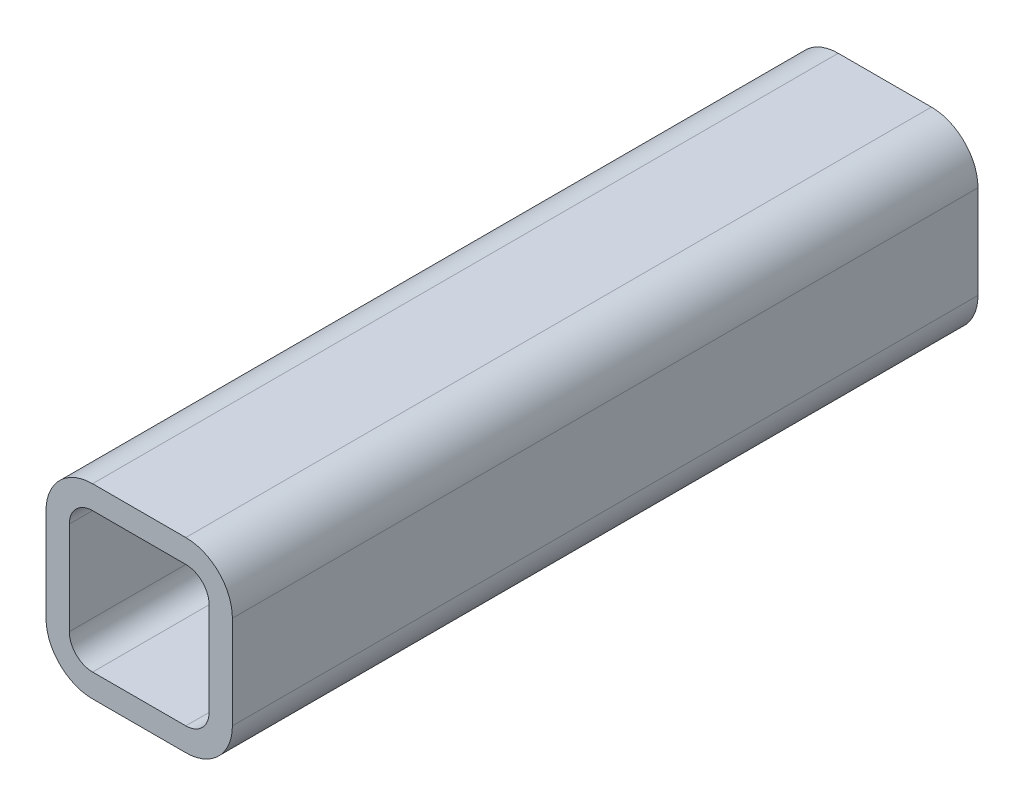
ISO-10303-21;
HEADER;
FILE_DESCRIPTION(('STEP AP214'),'2;1');
FILE_NAME('part.step','',(''),(''),'','','');
FILE_SCHEMA(('AUTOMOTIVE_DESIGN { 1 0 10303 214 1 1 1 1 }'));
ENDSEC;
DATA;
#1=APPLICATION_CONTEXT('core data for automotive mechanical design processes');
#2=APPLICATION_PROTOCOL_DEFINITION('international standard','automotive_design',2000,#1);
#3=PRODUCT_CONTEXT('',#1,'mechanical');
#4=PRODUCT('Part','Part','',(#3));
#5=PRODUCT_RELATED_PRODUCT_CATEGORY('part','',(#4));
#6=PRODUCT_DEFINITION_FORMATION('','',#4);
#7=PRODUCT_DEFINITION_CONTEXT('part definition',#1,'design');
#8=PRODUCT_DEFINITION('design','',#6,#7);
#9=PRODUCT_DEFINITION_SHAPE('','',#8);
#10=(LENGTH_UNIT() NAMED_UNIT(*) SI_UNIT(.MILLI.,.METRE.));
#11=(NAMED_UNIT(*) PLANE_ANGLE_UNIT() SI_UNIT($,.RADIAN.));
#12=(NAMED_UNIT(*) SI_UNIT($,.STERADIAN.) SOLID_ANGLE_UNIT());
#13=UNCERTAINTY_MEASURE_WITH_UNIT(LENGTH_MEASURE(1.E-05),#10,'distance_accuracy_value','');
#14=(GEOMETRIC_REPRESENTATION_CONTEXT(3) GLOBAL_UNCERTAINTY_ASSIGNED_CONTEXT((#13)) GLOBAL_UNIT_ASSIGNED_CONTEXT((#10,
#11,#12)) REPRESENTATION_CONTEXT('',''));
#15=CARTESIAN_POINT('',(0.,0.,0.));
#16=DIRECTION('',(0.,0.,1.));
#17=DIRECTION('',(1.,0.,0.));
#18=AXIS2_PLACEMENT_3D('',#15,#16,#17);
#19=CARTESIAN_POINT('',(21.5391160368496,59.2306737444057,304.8));
#20=DIRECTION('',(0.,0.,1.));
#21=DIRECTION('',(1.,0.,0.));
#22=AXIS2_PLACEMENT_3D('',#19,#20,#21);
#23=PLANE('',#22);
#24=CARTESIAN_POINT('',(21.5391160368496,59.2306737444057,304.8));
#25=DIRECTION('',(0.,0.,1.));
#26=DIRECTION('',(1.,0.,0.));
#27=AXIS2_PLACEMENT_3D('',#24,#25,#26);
#28=CIRCLE('',#27,19.05);
#29=CARTESIAN_POINT('',(21.5391160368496,78.2806737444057,304.8));
#30=VERTEX_POINT('',#29);
#31=CARTESIAN_POINT('',(2.48911603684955,59.2306737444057,304.8));
#32=VERTEX_POINT('',#31);
#33=EDGE_CURVE('E211',#30,#32,#28,.T.);
#34=ORIENTED_EDGE('',*,*,#33,.T.);
#35=DIRECTION('',(0.,-1.,0.));
#36=VECTOR('',#35,1.);
#37=CARTESIAN_POINT('',(2.48911603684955,21.1306737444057,304.8));
#38=LINE('',#37,#36);
#39=CARTESIAN_POINT('',(2.48911603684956,21.1306737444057,304.8));
#40=VERTEX_POINT('',#39);
#41=EDGE_CURVE('E214',#32,#40,#38,.T.);
#42=ORIENTED_EDGE('',*,*,#41,.T.);
#43=CARTESIAN_POINT('',(21.5391160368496,21.1306737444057,304.8));
#44=DIRECTION('',(0.,0.,1.));
#45=DIRECTION('',(1.,0.,0.));
#46=AXIS2_PLACEMENT_3D('',#43,#44,#45);
#47=CIRCLE('',#46,19.05);
#48=CARTESIAN_POINT('',(21.5391160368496,2.0806737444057,304.8));
#49=VERTEX_POINT('',#48);
#50=EDGE_CURVE('E217',#40,#49,#47,.T.);
#51=ORIENTED_EDGE('',*,*,#50,.T.);
#52=DIRECTION('',(1.,0.,0.));
#53=VECTOR('',#52,1.);
#54=CARTESIAN_POINT('',(59.6391160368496,2.0806737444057,304.8));
#55=LINE('',#54,#53);
#56=CARTESIAN_POINT('',(59.6391160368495,2.08067374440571,304.8));
#57=VERTEX_POINT('',#56);
#58=EDGE_CURVE('E219',#49,#57,#55,.T.);
#59=ORIENTED_EDGE('',*,*,#58,.T.);
#60=CARTESIAN_POINT('',(59.6391160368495,21.1306737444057,304.8));
#61=DIRECTION('',(0.,0.,1.));
#62=DIRECTION('',(1.,0.,0.));
#63=AXIS2_PLACEMENT_3D('',#60,#61,#62);
#64=CIRCLE('',#63,19.05);
#65=CARTESIAN_POINT('',(78.6891160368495,21.1306737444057,304.8));
#66=VERTEX_POINT('',#65);
#67=EDGE_CURVE('E221',#57,#66,#64,.T.);
#68=ORIENTED_EDGE('',*,*,#67,.T.);
#69=DIRECTION('',(0.,1.,0.));
#70=VECTOR('',#69,1.);
#71=CARTESIAN_POINT('',(78.6891160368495,59.2306737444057,304.8));
#72=LINE('',#71,#70);
#73=CARTESIAN_POINT('',(78.6891160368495,59.2306737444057,304.8));
#74=VERTEX_POINT('',#73);
#75=EDGE_CURVE('E223',#66,#74,#72,.T.);
#76=ORIENTED_EDGE('',*,*,#75,.T.);
#77=CARTESIAN_POINT('',(59.6391160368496,59.2306737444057,304.8));
#78=DIRECTION('',(0.,0.,1.));
#79=DIRECTION('',(1.,0.,0.));
#80=AXIS2_PLACEMENT_3D('',#77,#78,#79);
#81=CIRCLE('',#80,19.05);
#82=CARTESIAN_POINT('',(59.6391160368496,78.2806737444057,304.8));
#83=VERTEX_POINT('',#82);
#84=EDGE_CURVE('E225',#74,#83,#81,.T.);
#85=ORIENTED_EDGE('',*,*,#84,.T.);
#86=DIRECTION('',(-1.,0.,0.));
#87=VECTOR('',#86,1.);
#88=CARTESIAN_POINT('',(21.5391160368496,78.2806737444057,304.8));
#89=LINE('',#88,#87);
#90=EDGE_CURVE('E227',#83,#30,#89,.T.);
#91=ORIENTED_EDGE('',*,*,#90,.T.);
#92=EDGE_LOOP('',(#34,#42,#51,#59,#68,#76,#85,#91));
#93=FACE_BOUND('',#92,.T.);
#94=DIRECTION('',(0.,-1.,0.));
#95=VECTOR('',#94,1.);
#96=CARTESIAN_POINT('',(12.0141160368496,21.1306737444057,304.8));
#97=LINE('',#96,#95);
#98=CARTESIAN_POINT('',(12.0141160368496,59.2306737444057,304.8));
#99=VERTEX_POINT('',#98);
#100=CARTESIAN_POINT('',(12.0141160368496,21.1306737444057,304.8));
#101=VERTEX_POINT('',#100);
#102=EDGE_CURVE('E154',#99,#101,#97,.T.);
#103=ORIENTED_EDGE('',*,*,#102,.F.);
#104=CARTESIAN_POINT('',(21.5391160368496,59.2306737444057,304.8));
#105=DIRECTION('',(0.,0.,1.));
#106=DIRECTION('',(1.,0.,0.));
#107=AXIS2_PLACEMENT_3D('',#104,#105,#106);
#108=CIRCLE('',#107,9.52500000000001);
#109=CARTESIAN_POINT('',(21.5391160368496,68.7556737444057,304.8));
#110=VERTEX_POINT('',#109);
#111=EDGE_CURVE('E146',#110,#99,#108,.T.);
#112=ORIENTED_EDGE('',*,*,#111,.F.);
#113=DIRECTION('',(-1.,0.,0.));
#114=VECTOR('',#113,1.);
#115=CARTESIAN_POINT('',(21.5391160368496,68.7556737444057,304.8));
#116=LINE('',#115,#114);
#117=CARTESIAN_POINT('',(59.6391160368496,68.7556737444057,304.8));
#118=VERTEX_POINT('',#117);
#119=EDGE_CURVE('E179',#118,#110,#116,.T.);
#120=ORIENTED_EDGE('',*,*,#119,.F.);
#121=CARTESIAN_POINT('',(59.6391160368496,59.2306737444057,304.8));
#122=DIRECTION('',(0.,0.,1.));
#123=DIRECTION('',(1.,0.,0.));
#124=AXIS2_PLACEMENT_3D('',#121,#122,#123);
#125=CIRCLE('',#124,9.525);
#126=CARTESIAN_POINT('',(69.1641160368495,59.2306737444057,304.8));
#127=VERTEX_POINT('',#126);
#128=EDGE_CURVE('E177',#127,#118,#125,.T.);
#129=ORIENTED_EDGE('',*,*,#128,.F.);
#130=DIRECTION('',(0.,1.,0.));
#131=VECTOR('',#130,1.);
#132=CARTESIAN_POINT('',(69.1641160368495,59.2306737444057,304.8));
#133=LINE('',#132,#131);
#134=CARTESIAN_POINT('',(69.1641160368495,21.1306737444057,304.8));
#135=VERTEX_POINT('',#134);
#136=EDGE_CURVE('E175',#135,#127,#133,.T.);
#137=ORIENTED_EDGE('',*,*,#136,.F.);
#138=CARTESIAN_POINT('',(59.6391160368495,21.1306737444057,304.8));
#139=DIRECTION('',(0.,0.,1.));
#140=DIRECTION('',(1.,0.,0.));
#141=AXIS2_PLACEMENT_3D('',#138,#139,#140);
#142=CIRCLE('',#141,9.525);
#143=CARTESIAN_POINT('',(59.6391160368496,11.6056737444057,304.8));
#144=VERTEX_POINT('',#143);
#145=EDGE_CURVE('E173',#144,#135,#142,.T.);
#146=ORIENTED_EDGE('',*,*,#145,.F.);
#147=DIRECTION('',(1.,0.,0.));
#148=VECTOR('',#147,1.);
#149=CARTESIAN_POINT('',(59.6391160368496,11.6056737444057,304.8));
#150=LINE('',#149,#148);
#151=CARTESIAN_POINT('',(21.5391160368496,11.6056737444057,304.8));
#152=VERTEX_POINT('',#151);
#153=EDGE_CURVE('E169',#152,#144,#150,.T.);
#154=ORIENTED_EDGE('',*,*,#153,.F.);
#155=CARTESIAN_POINT('',(21.5391160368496,21.1306737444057,304.8));
#156=DIRECTION('',(0.,0.,1.));
#157=DIRECTION('',(1.,0.,0.));
#158=AXIS2_PLACEMENT_3D('',#155,#156,#157);
#159=CIRCLE('',#158,9.525);
#160=EDGE_CURVE('E167',#101,#152,#159,.T.);
#161=ORIENTED_EDGE('',*,*,#160,.F.);
#162=EDGE_LOOP('',(#103,#112,#120,#129,#137,#146,#154,#161));
#163=FACE_BOUND('',#162,.T.);
#164=ADVANCED_FACE('F33',(#93,#163),#23,.T.);
#165=CARTESIAN_POINT('',(21.5391160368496,59.2306737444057,0.));
#166=DIRECTION('',(0.,0.,1.));
#167=DIRECTION('',(1.,0.,0.));
#168=AXIS2_PLACEMENT_3D('',#165,#166,#167);
#169=PLANE('',#168);
#170=CARTESIAN_POINT('',(21.5391160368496,59.2306737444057,0.));
#171=DIRECTION('',(0.,0.,1.));
#172=DIRECTION('',(1.,0.,0.));
#173=AXIS2_PLACEMENT_3D('',#170,#171,#172);
#174=CIRCLE('',#173,19.05);
#175=CARTESIAN_POINT('',(21.5391160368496,78.2806737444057,0.));
#176=VERTEX_POINT('',#175);
#177=CARTESIAN_POINT('',(2.48911603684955,59.2306737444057,0.));
#178=VERTEX_POINT('',#177);
#179=EDGE_CURVE('E162',#176,#178,#174,.T.);
#180=ORIENTED_EDGE('',*,*,#179,.F.);
#181=DIRECTION('',(-1.,0.,0.));
#182=VECTOR('',#181,1.);
#183=CARTESIAN_POINT('',(21.5391160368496,78.2806737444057,0.));
#184=LINE('',#183,#182);
#185=CARTESIAN_POINT('',(59.6391160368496,78.2806737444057,0.));
#186=VERTEX_POINT('',#185);
#187=EDGE_CURVE('E215',#186,#176,#184,.T.);
#188=ORIENTED_EDGE('',*,*,#187,.F.);
#189=CARTESIAN_POINT('',(59.6391160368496,59.2306737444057,0.));
#190=DIRECTION('',(0.,0.,1.));
#191=DIRECTION('',(1.,0.,0.));
#192=AXIS2_PLACEMENT_3D('',#189,#190,#191);
#193=CIRCLE('',#192,19.05);
#194=CARTESIAN_POINT('',(78.6891160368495,59.2306737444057,0.));
#195=VERTEX_POINT('',#194);
#196=EDGE_CURVE('E242',#195,#186,#193,.T.);
#197=ORIENTED_EDGE('',*,*,#196,.F.);
#198=DIRECTION('',(0.,1.,0.));
#199=VECTOR('',#198,1.);
#200=CARTESIAN_POINT('',(78.6891160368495,59.2306737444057,0.));
#201=LINE('',#200,#199);
#202=CARTESIAN_POINT('',(78.6891160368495,21.1306737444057,0.));
#203=VERTEX_POINT('',#202);
#204=EDGE_CURVE('E240',#203,#195,#201,.T.);
#205=ORIENTED_EDGE('',*,*,#204,.F.);
#206=CARTESIAN_POINT('',(59.6391160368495,21.1306737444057,0.));
#207=DIRECTION('',(0.,0.,1.));
#208=DIRECTION('',(1.,0.,0.));
#209=AXIS2_PLACEMENT_3D('',#206,#207,#208);
#210=CIRCLE('',#209,19.05);
#211=CARTESIAN_POINT('',(59.6391160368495,2.08067374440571,0.));
#212=VERTEX_POINT('',#211);
#213=EDGE_CURVE('E238',#212,#203,#210,.T.);
#214=ORIENTED_EDGE('',*,*,#213,.F.);
#215=DIRECTION('',(1.,0.,0.));
#216=VECTOR('',#215,1.);
#217=CARTESIAN_POINT('',(59.6391160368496,2.0806737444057,0.));
#218=LINE('',#217,#216);
#219=CARTESIAN_POINT('',(21.5391160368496,2.0806737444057,0.));
#220=VERTEX_POINT('',#219);
#221=EDGE_CURVE('E236',#220,#212,#218,.T.);
#222=ORIENTED_EDGE('',*,*,#221,.F.);
#223=CARTESIAN_POINT('',(21.5391160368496,21.1306737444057,0.));
#224=DIRECTION('',(0.,0.,1.));
#225=DIRECTION('',(1.,0.,0.));
#226=AXIS2_PLACEMENT_3D('',#223,#224,#225);
#227=CIRCLE('',#226,19.05);
#228=CARTESIAN_POINT('',(2.48911603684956,21.1306737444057,0.));
#229=VERTEX_POINT('',#228);
#230=EDGE_CURVE('E234',#229,#220,#227,.T.);
#231=ORIENTED_EDGE('',*,*,#230,.F.);
#232=DIRECTION('',(0.,-1.,0.));
#233=VECTOR('',#232,1.);
#234=CARTESIAN_POINT('',(2.48911603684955,21.1306737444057,0.));
#235=LINE('',#234,#233);
#236=EDGE_CURVE('E232',#178,#229,#235,.T.);
#237=ORIENTED_EDGE('',*,*,#236,.F.);
#238=EDGE_LOOP('',(#180,#188,#197,#205,#214,#222,#231,#237));
#239=FACE_BOUND('',#238,.T.);
#240=CARTESIAN_POINT('',(21.5391160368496,59.2306737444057,0.));
#241=DIRECTION('',(0.,0.,1.));
#242=DIRECTION('',(1.,0.,0.));
#243=AXIS2_PLACEMENT_3D('',#240,#241,#242);
#244=CIRCLE('',#243,9.52500000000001);
#245=CARTESIAN_POINT('',(21.5391160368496,68.7556737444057,0.));
#246=VERTEX_POINT('',#245);
#247=CARTESIAN_POINT('',(12.0141160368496,59.2306737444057,0.));
#248=VERTEX_POINT('',#247);
#249=EDGE_CURVE('E56',#246,#248,#244,.T.);
#250=ORIENTED_EDGE('',*,*,#249,.T.);
#251=DIRECTION('',(0.,-1.,0.));
#252=VECTOR('',#251,1.);
#253=CARTESIAN_POINT('',(12.0141160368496,21.1306737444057,0.));
#254=LINE('',#253,#252);
#255=CARTESIAN_POINT('',(12.0141160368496,21.1306737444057,0.));
#256=VERTEX_POINT('',#255);
#257=EDGE_CURVE('E161',#248,#256,#254,.T.);
#258=ORIENTED_EDGE('',*,*,#257,.T.);
#259=CARTESIAN_POINT('',(21.5391160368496,21.1306737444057,0.));
#260=DIRECTION('',(0.,0.,1.));
#261=DIRECTION('',(1.,0.,0.));
#262=AXIS2_PLACEMENT_3D('',#259,#260,#261);
#263=CIRCLE('',#262,9.525);
#264=CARTESIAN_POINT('',(21.5391160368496,11.6056737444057,0.));
#265=VERTEX_POINT('',#264);
#266=EDGE_CURVE('E183',#256,#265,#263,.T.);
#267=ORIENTED_EDGE('',*,*,#266,.T.);
#268=DIRECTION('',(1.,0.,0.));
#269=VECTOR('',#268,1.);
#270=CARTESIAN_POINT('',(59.6391160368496,11.6056737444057,0.));
#271=LINE('',#270,#269);
#272=CARTESIAN_POINT('',(59.6391160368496,11.6056737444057,0.));
#273=VERTEX_POINT('',#272);
#274=EDGE_CURVE('E186',#265,#273,#271,.T.);
#275=ORIENTED_EDGE('',*,*,#274,.T.);
#276=CARTESIAN_POINT('',(59.6391160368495,21.1306737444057,0.));
#277=DIRECTION('',(0.,0.,1.));
#278=DIRECTION('',(1.,0.,0.));
#279=AXIS2_PLACEMENT_3D('',#276,#277,#278);
#280=CIRCLE('',#279,9.525);
#281=CARTESIAN_POINT('',(69.1641160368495,21.1306737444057,0.));
#282=VERTEX_POINT('',#281);
#283=EDGE_CURVE('E189',#273,#282,#280,.T.);
#284=ORIENTED_EDGE('',*,*,#283,.T.);
#285=DIRECTION('',(0.,1.,0.));
#286=VECTOR('',#285,1.);
#287=CARTESIAN_POINT('',(69.1641160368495,59.2306737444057,0.));
#288=LINE('',#287,#286);
#289=CARTESIAN_POINT('',(69.1641160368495,59.2306737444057,0.));
#290=VERTEX_POINT('',#289);
#291=EDGE_CURVE('E192',#282,#290,#288,.T.);
#292=ORIENTED_EDGE('',*,*,#291,.T.);
#293=CARTESIAN_POINT('',(59.6391160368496,59.2306737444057,0.));
#294=DIRECTION('',(0.,0.,1.));
#295=DIRECTION('',(1.,0.,0.));
#296=AXIS2_PLACEMENT_3D('',#293,#294,#295);
#297=CIRCLE('',#296,9.525);
#298=CARTESIAN_POINT('',(59.6391160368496,68.7556737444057,0.));
#299=VERTEX_POINT('',#298);
#300=EDGE_CURVE('E195',#290,#299,#297,.T.);
#301=ORIENTED_EDGE('',*,*,#300,.T.);
#302=DIRECTION('',(-1.,0.,0.));
#303=VECTOR('',#302,1.);
#304=CARTESIAN_POINT('',(21.5391160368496,68.7556737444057,0.));
#305=LINE('',#304,#303);
#306=EDGE_CURVE('E155',#299,#246,#305,.T.);
#307=ORIENTED_EDGE('',*,*,#306,.T.);
#308=EDGE_LOOP('',(#250,#258,#267,#275,#284,#292,#301,#307));
#309=FACE_BOUND('',#308,.T.);
#310=ADVANCED_FACE('F272',(#239,#309),#169,.F.);
#311=CARTESIAN_POINT('',(21.5391160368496,59.2306737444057,304.8));
#312=DIRECTION('',(0.,0.,-1.));
#313=DIRECTION('',(-1.,0.,0.));
#314=AXIS2_PLACEMENT_3D('',#311,#312,#313);
#315=CYLINDRICAL_SURFACE('',#314,19.05);
#316=ORIENTED_EDGE('',*,*,#179,.T.);
#317=DIRECTION('',(0.,0.,-1.));
#318=VECTOR('',#317,1.);
#319=CARTESIAN_POINT('',(2.48911603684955,59.2306737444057,304.8));
#320=LINE('',#319,#318);
#321=EDGE_CURVE('E11',#32,#178,#320,.T.);
#322=ORIENTED_EDGE('',*,*,#321,.F.);
#323=ORIENTED_EDGE('',*,*,#33,.F.);
#324=DIRECTION('',(0.,0.,-1.));
#325=VECTOR('',#324,1.);
#326=CARTESIAN_POINT('',(21.5391160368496,78.2806737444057,304.8));
#327=LINE('',#326,#325);
#328=EDGE_CURVE('E229',#30,#176,#327,.T.);
#329=ORIENTED_EDGE('',*,*,#328,.T.);
#330=EDGE_LOOP('',(#316,#322,#323,#329));
#331=FACE_BOUND('',#330,.T.);
#332=ADVANCED_FACE('F35',(#331),#315,.T.);
#333=CARTESIAN_POINT('',(2.48911603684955,21.1306737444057,304.8));
#334=DIRECTION('',(1.,0.,0.));
#335=DIRECTION('',(0.,0.,-1.));
#336=AXIS2_PLACEMENT_3D('',#333,#334,#335);
#337=PLANE('',#336);
#338=ORIENTED_EDGE('',*,*,#236,.T.);
#339=DIRECTION('',(0.,0.,-1.));
#340=VECTOR('',#339,1.);
#341=CARTESIAN_POINT('',(2.48911603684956,21.1306737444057,304.8));
#342=LINE('',#341,#340);
#343=EDGE_CURVE('E41',#40,#229,#342,.T.);
#344=ORIENTED_EDGE('',*,*,#343,.F.);
#345=ORIENTED_EDGE('',*,*,#41,.F.);
#346=ORIENTED_EDGE('',*,*,#321,.T.);
#347=EDGE_LOOP('',(#338,#344,#345,#346));
#348=FACE_BOUND('',#347,.T.);
#349=ADVANCED_FACE('F289',(#348),#337,.F.);
#350=CARTESIAN_POINT('',(21.5391160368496,21.1306737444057,304.8));
#351=DIRECTION('',(0.,0.,-1.));
#352=DIRECTION('',(-1.,0.,0.));
#353=AXIS2_PLACEMENT_3D('',#350,#351,#352);
#354=CYLINDRICAL_SURFACE('',#353,19.05);
#355=ORIENTED_EDGE('',*,*,#230,.T.);
#356=DIRECTION('',(0.,0.,-1.));
#357=VECTOR('',#356,1.);
#358=CARTESIAN_POINT('',(21.5391160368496,2.0806737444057,304.8));
#359=LINE('',#358,#357);
#360=EDGE_CURVE('E259',#49,#220,#359,.T.);
#361=ORIENTED_EDGE('',*,*,#360,.F.);
#362=ORIENTED_EDGE('',*,*,#50,.F.);
#363=ORIENTED_EDGE('',*,*,#343,.T.);
#364=EDGE_LOOP('',(#355,#361,#362,#363));
#365=FACE_BOUND('',#364,.T.);
#366=ADVANCED_FACE('F266',(#365),#354,.T.);
#367=CARTESIAN_POINT('',(59.6391160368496,2.0806737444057,304.8));
#368=DIRECTION('',(0.,1.,0.));
#369=DIRECTION('',(0.,0.,1.));
#370=AXIS2_PLACEMENT_3D('',#367,#368,#369);
#371=PLANE('',#370);
#372=ORIENTED_EDGE('',*,*,#221,.T.);
#373=DIRECTION('',(0.,0.,-1.));
#374=VECTOR('',#373,1.);
#375=CARTESIAN_POINT('',(59.6391160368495,2.08067374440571,304.8));
#376=LINE('',#375,#374);
#377=EDGE_CURVE('E256',#57,#212,#376,.T.);
#378=ORIENTED_EDGE('',*,*,#377,.F.);
#379=ORIENTED_EDGE('',*,*,#58,.F.);
#380=ORIENTED_EDGE('',*,*,#360,.T.);
#381=EDGE_LOOP('',(#372,#378,#379,#380));
#382=FACE_BOUND('',#381,.T.);
#383=ADVANCED_FACE('F278',(#382),#371,.F.);
#384=CARTESIAN_POINT('',(59.6391160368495,21.1306737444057,304.8));
#385=DIRECTION('',(0.,0.,-1.));
#386=DIRECTION('',(-1.,0.,0.));
#387=AXIS2_PLACEMENT_3D('',#384,#385,#386);
#388=CYLINDRICAL_SURFACE('',#387,19.05);
#389=ORIENTED_EDGE('',*,*,#213,.T.);
#390=DIRECTION('',(0.,0.,-1.));
#391=VECTOR('',#390,1.);
#392=CARTESIAN_POINT('',(78.6891160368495,21.1306737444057,304.8));
#393=LINE('',#392,#391);
#394=EDGE_CURVE('E253',#66,#203,#393,.T.);
#395=ORIENTED_EDGE('',*,*,#394,.F.);
#396=ORIENTED_EDGE('',*,*,#67,.F.);
#397=ORIENTED_EDGE('',*,*,#377,.T.);
#398=EDGE_LOOP('',(#389,#395,#396,#397));
#399=FACE_BOUND('',#398,.T.);
#400=ADVANCED_FACE('F282',(#399),#388,.T.);
#401=CARTESIAN_POINT('',(78.6891160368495,59.2306737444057,304.8));
#402=DIRECTION('',(-1.,0.,0.));
#403=DIRECTION('',(0.,0.,1.));
#404=AXIS2_PLACEMENT_3D('',#401,#402,#403);
#405=PLANE('',#404);
#406=ORIENTED_EDGE('',*,*,#204,.T.);
#407=DIRECTION('',(0.,0.,-1.));
#408=VECTOR('',#407,1.);
#409=CARTESIAN_POINT('',(78.6891160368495,59.2306737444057,304.8));
#410=LINE('',#409,#408);
#411=EDGE_CURVE('E250',#74,#195,#410,.T.);
#412=ORIENTED_EDGE('',*,*,#411,.F.);
#413=ORIENTED_EDGE('',*,*,#75,.F.);
#414=ORIENTED_EDGE('',*,*,#394,.T.);
#415=EDGE_LOOP('',(#406,#412,#413,#414));
#416=FACE_BOUND('',#415,.T.);
#417=ADVANCED_FACE('F302',(#416),#405,.F.);
#418=CARTESIAN_POINT('',(59.6391160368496,59.2306737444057,304.8));
#419=DIRECTION('',(0.,0.,-1.));
#420=DIRECTION('',(-1.,0.,0.));
#421=AXIS2_PLACEMENT_3D('',#418,#419,#420);
#422=CYLINDRICAL_SURFACE('',#421,19.05);
#423=ORIENTED_EDGE('',*,*,#196,.T.);
#424=DIRECTION('',(0.,0.,-1.));
#425=VECTOR('',#424,1.);
#426=CARTESIAN_POINT('',(59.6391160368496,78.2806737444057,304.8));
#427=LINE('',#426,#425);
#428=EDGE_CURVE('E247',#83,#186,#427,.T.);
#429=ORIENTED_EDGE('',*,*,#428,.F.);
#430=ORIENTED_EDGE('',*,*,#84,.F.);
#431=ORIENTED_EDGE('',*,*,#411,.T.);
#432=EDGE_LOOP('',(#423,#429,#430,#431));
#433=FACE_BOUND('',#432,.T.);
#434=ADVANCED_FACE('F300',(#433),#422,.T.);
#435=CARTESIAN_POINT('',(21.5391160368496,78.2806737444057,304.8));
#436=DIRECTION('',(0.,-1.,0.));
#437=DIRECTION('',(0.,0.,-1.));
#438=AXIS2_PLACEMENT_3D('',#435,#436,#437);
#439=PLANE('',#438);
#440=ORIENTED_EDGE('',*,*,#187,.T.);
#441=ORIENTED_EDGE('',*,*,#328,.F.);
#442=ORIENTED_EDGE('',*,*,#90,.F.);
#443=ORIENTED_EDGE('',*,*,#428,.T.);
#444=EDGE_LOOP('',(#440,#441,#442,#443));
#445=FACE_BOUND('',#444,.T.);
#446=ADVANCED_FACE('F295',(#445),#439,.F.);
#447=CARTESIAN_POINT('',(21.5391160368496,59.2306737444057,304.8));
#448=DIRECTION('',(0.,0.,-1.));
#449=DIRECTION('',(-1.,0.,0.));
#450=AXIS2_PLACEMENT_3D('',#447,#448,#449);
#451=CYLINDRICAL_SURFACE('',#450,9.52500000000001);
#452=ORIENTED_EDGE('',*,*,#249,.F.);
#453=DIRECTION('',(0.,0.,-1.));
#454=VECTOR('',#453,1.);
#455=CARTESIAN_POINT('',(21.5391160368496,68.7556737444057,304.8));
#456=LINE('',#455,#454);
#457=EDGE_CURVE('E150',#110,#246,#456,.T.);
#458=ORIENTED_EDGE('',*,*,#457,.F.);
#459=ORIENTED_EDGE('',*,*,#111,.T.);
#460=DIRECTION('',(0.,0.,-1.));
#461=VECTOR('',#460,1.);
#462=CARTESIAN_POINT('',(12.0141160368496,59.2306737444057,304.8));
#463=LINE('',#462,#461);
#464=EDGE_CURVE('E149',#99,#248,#463,.T.);
#465=ORIENTED_EDGE('',*,*,#464,.T.);
#466=EDGE_LOOP('',(#452,#458,#459,#465));
#467=FACE_BOUND('',#466,.T.);
#468=ADVANCED_FACE('F148',(#467),#451,.F.);
#469=CARTESIAN_POINT('',(12.0141160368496,21.1306737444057,304.8));
#470=DIRECTION('',(1.,0.,0.));
#471=DIRECTION('',(0.,0.,-1.));
#472=AXIS2_PLACEMENT_3D('',#469,#470,#471);
#473=PLANE('',#472);
#474=ORIENTED_EDGE('',*,*,#257,.F.);
#475=ORIENTED_EDGE('',*,*,#464,.F.);
#476=ORIENTED_EDGE('',*,*,#102,.T.);
#477=DIRECTION('',(0.,0.,-1.));
#478=VECTOR('',#477,1.);
#479=CARTESIAN_POINT('',(12.0141160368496,21.1306737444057,304.8));
#480=LINE('',#479,#478);
#481=EDGE_CURVE('E163',#101,#256,#480,.T.);
#482=ORIENTED_EDGE('',*,*,#481,.T.);
#483=EDGE_LOOP('',(#474,#475,#476,#482));
#484=FACE_BOUND('',#483,.T.);
#485=ADVANCED_FACE('F158',(#484),#473,.T.);
#486=CARTESIAN_POINT('',(21.5391160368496,21.1306737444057,304.8));
#487=DIRECTION('',(0.,0.,-1.));
#488=DIRECTION('',(-1.,0.,0.));
#489=AXIS2_PLACEMENT_3D('',#486,#487,#488);
#490=CYLINDRICAL_SURFACE('',#489,9.525);
#491=ORIENTED_EDGE('',*,*,#266,.F.);
#492=ORIENTED_EDGE('',*,*,#481,.F.);
#493=ORIENTED_EDGE('',*,*,#160,.T.);
#494=DIRECTION('',(0.,0.,-1.));
#495=VECTOR('',#494,1.);
#496=CARTESIAN_POINT('',(21.5391160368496,11.6056737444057,304.8));
#497=LINE('',#496,#495);
#498=EDGE_CURVE('E208',#152,#265,#497,.T.);
#499=ORIENTED_EDGE('',*,*,#498,.T.);
#500=EDGE_LOOP('',(#491,#492,#493,#499));
#501=FACE_BOUND('',#500,.T.);
#502=ADVANCED_FACE('F327',(#501),#490,.F.);
#503=CARTESIAN_POINT('',(59.6391160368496,11.6056737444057,304.8));
#504=DIRECTION('',(0.,1.,0.));
#505=DIRECTION('',(0.,0.,1.));
#506=AXIS2_PLACEMENT_3D('',#503,#504,#505);
#507=PLANE('',#506);
#508=ORIENTED_EDGE('',*,*,#274,.F.);
#509=ORIENTED_EDGE('',*,*,#498,.F.);
#510=ORIENTED_EDGE('',*,*,#153,.T.);
#511=DIRECTION('',(0.,0.,-1.));
#512=VECTOR('',#511,1.);
#513=CARTESIAN_POINT('',(59.6391160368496,11.6056737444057,304.8));
#514=LINE('',#513,#512);
#515=EDGE_CURVE('E206',#144,#273,#514,.T.);
#516=ORIENTED_EDGE('',*,*,#515,.T.);
#517=EDGE_LOOP('',(#508,#509,#510,#516));
#518=FACE_BOUND('',#517,.T.);
#519=ADVANCED_FACE('F331',(#518),#507,.T.);
#520=CARTESIAN_POINT('',(59.6391160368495,21.1306737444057,304.8));
#521=DIRECTION('',(0.,0.,-1.));
#522=DIRECTION('',(-1.,0.,0.));
#523=AXIS2_PLACEMENT_3D('',#520,#521,#522);
#524=CYLINDRICAL_SURFACE('',#523,9.525);
#525=ORIENTED_EDGE('',*,*,#283,.F.);
#526=ORIENTED_EDGE('',*,*,#515,.F.);
#527=ORIENTED_EDGE('',*,*,#145,.T.);
#528=DIRECTION('',(0.,0.,-1.));
#529=VECTOR('',#528,1.);
#530=CARTESIAN_POINT('',(69.1641160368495,21.1306737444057,304.8));
#531=LINE('',#530,#529);
#532=EDGE_CURVE('E204',#135,#282,#531,.T.);
#533=ORIENTED_EDGE('',*,*,#532,.T.);
#534=EDGE_LOOP('',(#525,#526,#527,#533));
#535=FACE_BOUND('',#534,.T.);
#536=ADVANCED_FACE('F337',(#535),#524,.F.);
#537=CARTESIAN_POINT('',(69.1641160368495,59.2306737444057,304.8));
#538=DIRECTION('',(-1.,0.,0.));
#539=DIRECTION('',(0.,0.,1.));
#540=AXIS2_PLACEMENT_3D('',#537,#538,#539);
#541=PLANE('',#540);
#542=ORIENTED_EDGE('',*,*,#291,.F.);
#543=ORIENTED_EDGE('',*,*,#532,.F.);
#544=ORIENTED_EDGE('',*,*,#136,.T.);
#545=DIRECTION('',(0.,0.,-1.));
#546=VECTOR('',#545,1.);
#547=CARTESIAN_POINT('',(69.1641160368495,59.2306737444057,304.8));
#548=LINE('',#547,#546);
#549=EDGE_CURVE('E202',#127,#290,#548,.T.);
#550=ORIENTED_EDGE('',*,*,#549,.T.);
#551=EDGE_LOOP('',(#542,#543,#544,#550));
#552=FACE_BOUND('',#551,.T.);
#553=ADVANCED_FACE('F341',(#552),#541,.T.);
#554=CARTESIAN_POINT('',(59.6391160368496,59.2306737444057,304.8));
#555=DIRECTION('',(0.,0.,-1.));
#556=DIRECTION('',(-1.,0.,0.));
#557=AXIS2_PLACEMENT_3D('',#554,#555,#556);
#558=CYLINDRICAL_SURFACE('',#557,9.525);
#559=ORIENTED_EDGE('',*,*,#300,.F.);
#560=ORIENTED_EDGE('',*,*,#549,.F.);
#561=ORIENTED_EDGE('',*,*,#128,.T.);
#562=DIRECTION('',(0.,0.,-1.));
#563=VECTOR('',#562,1.);
#564=CARTESIAN_POINT('',(59.6391160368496,68.7556737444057,304.8));
#565=LINE('',#564,#563);
#566=EDGE_CURVE('E48',#118,#299,#565,.T.);
#567=ORIENTED_EDGE('',*,*,#566,.T.);
#568=EDGE_LOOP('',(#559,#560,#561,#567));
#569=FACE_BOUND('',#568,.T.);
#570=ADVANCED_FACE('F345',(#569),#558,.F.);
#571=CARTESIAN_POINT('',(21.5391160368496,68.7556737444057,304.8));
#572=DIRECTION('',(0.,-1.,0.));
#573=DIRECTION('',(0.,0.,-1.));
#574=AXIS2_PLACEMENT_3D('',#571,#572,#573);
#575=PLANE('',#574);
#576=ORIENTED_EDGE('',*,*,#306,.F.);
#577=ORIENTED_EDGE('',*,*,#566,.F.);
#578=ORIENTED_EDGE('',*,*,#119,.T.);
#579=ORIENTED_EDGE('',*,*,#457,.T.);
#580=EDGE_LOOP('',(#576,#577,#578,#579));
#581=FACE_BOUND('',#580,.T.);
#582=ADVANCED_FACE('F349',(#581),#575,.T.);
#583=CLOSED_SHELL('',(#164,#310,#332,#349,#366,#383,#400,#417,#434,#446,#468,#485,#502,#519,
#536,#553,#570,#582));
#584=MANIFOLD_SOLID_BREP('B2',#583);
#585=ADVANCED_BREP_SHAPE_REPRESENTATION('',(#18,#584),#14);
#586=SHAPE_DEFINITION_REPRESENTATION(#9,#585);
ENDSEC;
END-ISO-10303-21;
